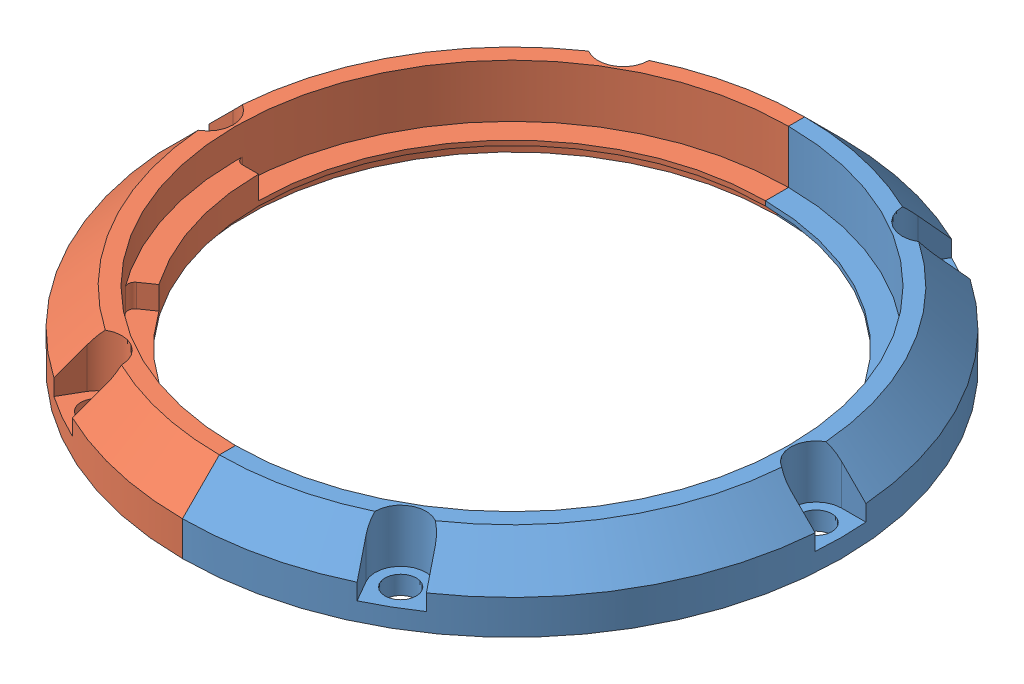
SolidWorks assembly C1A-XCA1-XT.sldasm, configuration ﾃﾞﾌｫﾙﾄ (file format 4700). Lengths in mm.
Overall size (143 15.5 143).
2 component instances, 2 part files, 0 mates.
Components (placement in the parent):
- TM MAX Angle adjust plate C-1: TM MAX Angle adjust plate C.sldprt [ﾃﾞﾌｫﾙﾄ] at origin size (71.5 15.5 143)
- TM MAX Angle adjust plate D-1: TM MAX Angle adjust plate D.sldprt [ﾃﾞﾌｫﾙﾄ] at (0 0 -145) x (-1 0 0) z (0 0 -1) size (71.5 15.5 143)
